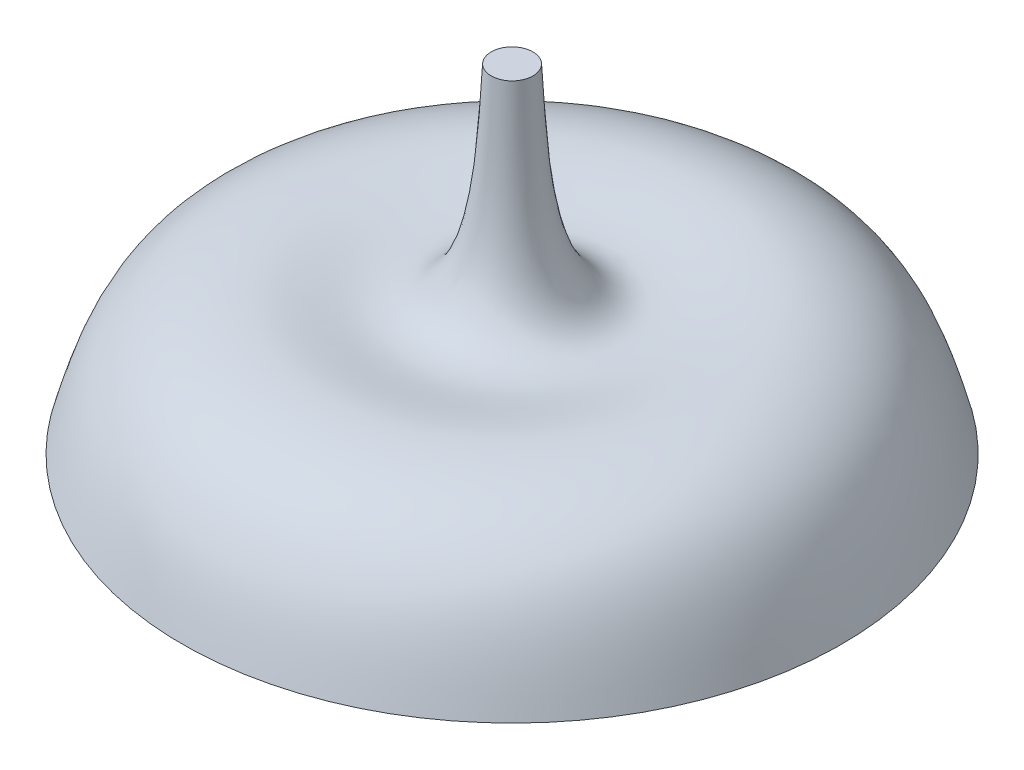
ISO-10303-21;
HEADER;
FILE_DESCRIPTION(('STEP AP214'),'2;1');
FILE_NAME('part.step','',(''),(''),'','','');
FILE_SCHEMA(('AUTOMOTIVE_DESIGN { 1 0 10303 214 1 1 1 1 }'));
ENDSEC;
DATA;
#1=APPLICATION_CONTEXT('core data for automotive mechanical design processes');
#2=APPLICATION_PROTOCOL_DEFINITION('international standard','automotive_design',2000,#1);
#3=PRODUCT_CONTEXT('',#1,'mechanical');
#4=PRODUCT('Part','Part','',(#3));
#5=PRODUCT_RELATED_PRODUCT_CATEGORY('part','',(#4));
#6=PRODUCT_DEFINITION_FORMATION('','',#4);
#7=PRODUCT_DEFINITION_CONTEXT('part definition',#1,'design');
#8=PRODUCT_DEFINITION('design','',#6,#7);
#9=PRODUCT_DEFINITION_SHAPE('','',#8);
#10=(LENGTH_UNIT() NAMED_UNIT(*) SI_UNIT(.MILLI.,.METRE.));
#11=(NAMED_UNIT(*) PLANE_ANGLE_UNIT() SI_UNIT($,.RADIAN.));
#12=(NAMED_UNIT(*) SI_UNIT($,.STERADIAN.) SOLID_ANGLE_UNIT());
#13=UNCERTAINTY_MEASURE_WITH_UNIT(LENGTH_MEASURE(1.E-05),#10,'distance_accuracy_value','');
#14=(GEOMETRIC_REPRESENTATION_CONTEXT(3) GLOBAL_UNCERTAINTY_ASSIGNED_CONTEXT((#13)) GLOBAL_UNIT_ASSIGNED_CONTEXT((#10,
#11,#12)) REPRESENTATION_CONTEXT('',''));
#15=CARTESIAN_POINT('',(0.,0.,0.));
#16=DIRECTION('',(0.,0.,1.));
#17=DIRECTION('',(1.,0.,0.));
#18=AXIS2_PLACEMENT_3D('',#15,#16,#17);
#19=CARTESIAN_POINT('',(-3.47045875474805,55.2185167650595,0.));
#20=DIRECTION('',(0.,1.,0.));
#21=DIRECTION('',(0.,0.,1.));
#22=AXIS2_PLACEMENT_3D('',#19,#20,#21);
#23=PLANE('',#22);
#24=CARTESIAN_POINT('',(0.,55.2185167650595,0.));
#25=DIRECTION('',(0.,-1.,0.));
#26=DIRECTION('',(0.,0.,-1.));
#27=AXIS2_PLACEMENT_3D('',#24,#25,#26);
#28=CIRCLE('',#27,2.51965239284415);
#29=CARTESIAN_POINT('',(0.,55.2185167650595,-2.51965239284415));
#30=VERTEX_POINT('',#29);
#31=EDGE_CURVE('E41',#30,#30,#28,.T.);
#32=ORIENTED_EDGE('',*,*,#31,.T.);
#33=EDGE_LOOP('',(#32));
#34=FACE_BOUND('',#33,.T.);
#35=ADVANCED_FACE('F27',(#34),#23,.F.);
#36=CARTESIAN_POINT('',(-3.47045875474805,56.2185167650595,0.));
#37=DIRECTION('',(0.,1.,0.));
#38=DIRECTION('',(0.,0.,1.));
#39=AXIS2_PLACEMENT_3D('',#36,#37,#38);
#40=PLANE('',#39);
#41=CARTESIAN_POINT('',(0.,56.2185167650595,0.));
#42=DIRECTION('',(0.,-1.,0.));
#43=DIRECTION('',(0.,0.,-1.));
#44=AXIS2_PLACEMENT_3D('',#41,#42,#43);
#45=CIRCLE('',#44,3.47045875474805);
#46=CARTESIAN_POINT('',(0.,56.2185167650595,-3.47045875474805));
#47=VERTEX_POINT('',#46);
#48=EDGE_CURVE('E10',#47,#47,#45,.T.);
#49=ORIENTED_EDGE('',*,*,#48,.F.);
#50=EDGE_LOOP('',(#49));
#51=FACE_BOUND('',#50,.T.);
#52=ADVANCED_FACE('F66',(#51),#40,.T.);
#53=CARTESIAN_POINT('',(-54.8363031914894,0.,0.));
#54=CARTESIAN_POINT('',(-53.0182619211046,6.5659522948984,0.));
#55=CARTESIAN_POINT('',(-49.5151056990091,19.2177864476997,0.));
#56=CARTESIAN_POINT('',(-31.0025272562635,25.634115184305,0.));
#57=CARTESIAN_POINT('',(-5.47576206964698,16.4263325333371,0.));
#58=CARTESIAN_POINT('',(-4.29754947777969,39.8061634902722,0.));
#59=CARTESIAN_POINT('',(-3.47045875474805,56.2185167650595,0.));
#60=B_SPLINE_CURVE_WITH_KNOTS('',3,(#53,#54,#55,#56,#57,#58,#59),.UNSPECIFIED.,.F.,.F.,(4,1,1,1,
4),(0.,0.217463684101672,0.419027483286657,0.592164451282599,1.),.UNSPECIFIED.);
#61=CARTESIAN_POINT('',(0.,0.,0.));
#62=DIRECTION('',(0.,-1.,0.));
#63=AXIS1_PLACEMENT('',#61,#62);
#64=SURFACE_OF_REVOLUTION('',#60,#63);
#65=ORIENTED_EDGE('',*,*,#48,.T.);
#66=EDGE_LOOP('',(#65));
#67=FACE_BOUND('',#66,.T.);
#68=CARTESIAN_POINT('',(0.,0.,0.));
#69=DIRECTION('',(0.,-1.,0.));
#70=DIRECTION('',(0.,0.,-1.));
#71=AXIS2_PLACEMENT_3D('',#68,#69,#70);
#72=CIRCLE('',#71,54.8363031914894);
#73=CARTESIAN_POINT('',(0.,0.,-54.8363031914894));
#74=VERTEX_POINT('',#73);
#75=EDGE_CURVE('E33',#74,#74,#72,.T.);
#76=ORIENTED_EDGE('',*,*,#75,.F.);
#77=EDGE_LOOP('',(#76));
#78=FACE_BOUND('',#77,.T.);
#79=ADVANCED_FACE('F64',(#67,#78),#64,.F.);
#80=CARTESIAN_POINT('',(0.,-0.266848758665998,0.));
#81=DIRECTION('',(0.,1.,0.));
#82=DIRECTION('',(0.,0.,1.));
#83=AXIS2_PLACEMENT_3D('',#80,#81,#82);
#84=CONICAL_SURFACE('',#83,53.8725647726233,1.3006745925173);
#85=ORIENTED_EDGE('',*,*,#75,.T.);
#86=EDGE_LOOP('',(#85));
#87=FACE_BOUND('',#86,.T.);
#88=CARTESIAN_POINT('',(0.,-0.266848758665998,0.));
#89=DIRECTION('',(0.,-1.,0.));
#90=DIRECTION('',(0.,0.,-1.));
#91=AXIS2_PLACEMENT_3D('',#88,#89,#90);
#92=CIRCLE('',#91,53.8725647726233);
#93=CARTESIAN_POINT('',(0.,-0.266848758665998,-53.8725647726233));
#94=VERTEX_POINT('',#93);
#95=EDGE_CURVE('E37',#94,#94,#92,.T.);
#96=ORIENTED_EDGE('',*,*,#95,.F.);
#97=EDGE_LOOP('',(#96));
#98=FACE_BOUND('',#97,.T.);
#99=ADVANCED_FACE('F60',(#87,#98),#84,.T.);
#100=CARTESIAN_POINT('',(-53.8725647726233,-0.266848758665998,0.));
#101=CARTESIAN_POINT('',(-53.3541616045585,1.60539172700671,0.));
#102=CARTESIAN_POINT('',(-52.8387328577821,3.46596512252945,0.));
#103=CARTESIAN_POINT('',(-51.6973709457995,7.06097630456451,0.));
#104=CARTESIAN_POINT('',(-51.071356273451,8.7951613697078,0.));
#105=CARTESIAN_POINT('',(-49.6005510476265,12.0344612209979,0.));
#106=CARTESIAN_POINT('',(-48.756182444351,13.5388719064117,0.));
#107=CARTESIAN_POINT('',(-47.2491287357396,15.5569570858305,0.));
#108=CARTESIAN_POINT('',(-46.70671005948,16.1901166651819,0.));
#109=CARTESIAN_POINT('',(-45.5271047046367,17.3690615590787,0.));
#110=CARTESIAN_POINT('',(-44.8861430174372,17.9183226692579,0.));
#111=CARTESIAN_POINT('',(-41.4573480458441,20.4523122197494,0.));
#112=CARTESIAN_POINT('',(-37.9947695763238,21.795786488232,0.));
#113=CARTESIAN_POINT('',(-33.3658350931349,22.419510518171,0.));
#114=CARTESIAN_POINT('',(-32.4252060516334,22.4916681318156,0.));
#115=CARTESIAN_POINT('',(-30.5296237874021,22.5265927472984,0.));
#116=CARTESIAN_POINT('',(-29.5767602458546,22.486435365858,0.));
#117=CARTESIAN_POINT('',(-26.6883696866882,22.2212283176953,0.));
#118=CARTESIAN_POINT('',(-24.7347180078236,21.8634425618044,0.));
#119=CARTESIAN_POINT('',(-20.9305656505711,21.1826062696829,0.));
#120=CARTESIAN_POINT('',(-19.0814198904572,20.8580011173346,0.));
#121=CARTESIAN_POINT('',(-16.4626525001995,20.7242165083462,0.));
#122=CARTESIAN_POINT('',(-15.6144604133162,20.7388086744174,0.));
#123=CARTESIAN_POINT('',(-14.3876208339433,20.9030079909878,0.));
#124=CARTESIAN_POINT('',(-13.9877231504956,20.9822004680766,0.));
#125=CARTESIAN_POINT('',(-13.2146661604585,21.1882798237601,0.));
#126=CARTESIAN_POINT('',(-12.8404360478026,21.3151634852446,0.));
#127=CARTESIAN_POINT('',(-11.756730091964,21.7641130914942,0.));
#128=CARTESIAN_POINT('',(-11.0867347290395,22.1546811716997,0.));
#129=CARTESIAN_POINT('',(-9.85628372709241,23.0921336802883,0.));
#130=CARTESIAN_POINT('',(-9.29571599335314,23.6385496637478,0.));
#131=CARTESIAN_POINT('',(-7.76459087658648,25.4724649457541,0.));
#132=CARTESIAN_POINT('',(-6.94297412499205,26.9520607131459,0.));
#133=CARTESIAN_POINT('',(-5.58537429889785,30.3021825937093,0.));
#134=CARTESIAN_POINT('',(-5.04918926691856,32.1752247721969,0.));
#135=CARTESIAN_POINT('',(-4.17795997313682,36.2251740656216,0.));
#136=CARTESIAN_POINT('',(-3.8434756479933,38.4022990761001,0.));
#137=CARTESIAN_POINT('',(-3.04047055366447,45.2463585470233,0.));
#138=CARTESIAN_POINT('',(-2.7722634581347,50.2271858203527,0.));
#139=CARTESIAN_POINT('',(-2.51965239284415,55.2185167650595,0.));
#140=B_SPLINE_CURVE_WITH_KNOTS('',3,(#100,#101,#102,#103,#104,#105,#106,#107,#108,#109,#110,
#111,#112,#113,#114,#115,#116,#117,#118,#119,#120,#121,#122,#123,#124,#125,#126,#127,#128,#129,
#130,#131,#132,#133,#134,#135,#136,#137,#138,#139),.UNSPECIFIED.,.F.,.F.,(4,2,2,2,2,2,2,2,2,2,2,
2,2,2,2,2,2,2,2,4),(0.,0.0625000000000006,0.125000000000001,0.187500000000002,0.218750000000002,
0.250000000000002,0.375000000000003,0.406250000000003,0.437500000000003,0.500000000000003,
0.562500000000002,0.593750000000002,0.609375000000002,0.625000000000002,0.656250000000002,
0.687500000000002,0.750000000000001,0.812500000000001,0.875000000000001,1.),.UNSPECIFIED.);
#141=CARTESIAN_POINT('',(0.,0.,0.));
#142=DIRECTION('',(0.,-1.,0.));
#143=AXIS1_PLACEMENT('',#141,#142);
#144=SURFACE_OF_REVOLUTION('',#140,#143);
#145=ORIENTED_EDGE('',*,*,#31,.F.);
#146=EDGE_LOOP('',(#145));
#147=FACE_BOUND('',#146,.T.);
#148=ORIENTED_EDGE('',*,*,#95,.T.);
#149=EDGE_LOOP('',(#148));
#150=FACE_BOUND('',#149,.T.);
#151=ADVANCED_FACE('F57',(#147,#150),#144,.T.);
#152=CLOSED_SHELL('',(#35,#52,#79,#99,#151));
#153=MANIFOLD_SOLID_BREP('B2',#152);
#154=ADVANCED_BREP_SHAPE_REPRESENTATION('',(#18,#153),#14);
#155=SHAPE_DEFINITION_REPRESENTATION(#9,#154);
ENDSEC;
END-ISO-10303-21;
